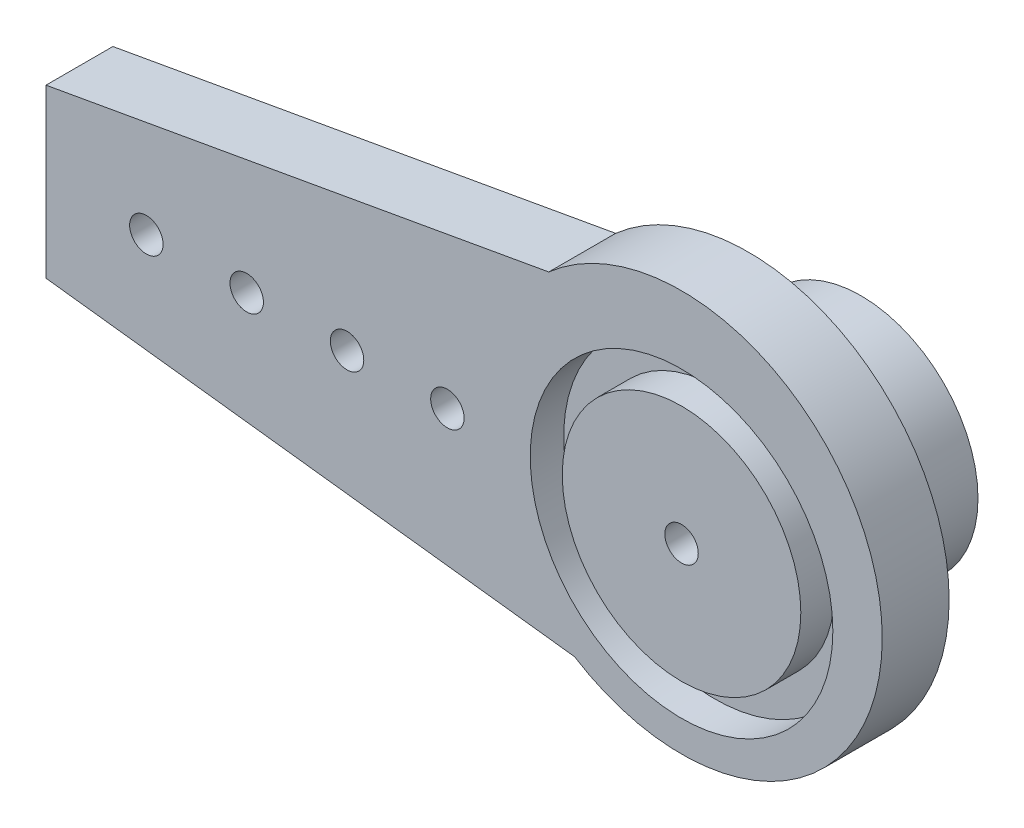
ISO-10303-21;
HEADER;
FILE_DESCRIPTION(('STEP AP214'),'2;1');
FILE_NAME('part.step','',(''),(''),'','','');
FILE_SCHEMA(('AUTOMOTIVE_DESIGN { 1 0 10303 214 1 1 1 1 }'));
ENDSEC;
DATA;
#1=APPLICATION_CONTEXT('core data for automotive mechanical design processes');
#2=APPLICATION_PROTOCOL_DEFINITION('international standard','automotive_design',2000,#1);
#3=PRODUCT_CONTEXT('',#1,'mechanical');
#4=PRODUCT('Part','Part','',(#3));
#5=PRODUCT_RELATED_PRODUCT_CATEGORY('part','',(#4));
#6=PRODUCT_DEFINITION_FORMATION('','',#4);
#7=PRODUCT_DEFINITION_CONTEXT('part definition',#1,'design');
#8=PRODUCT_DEFINITION('design','',#6,#7);
#9=PRODUCT_DEFINITION_SHAPE('','',#8);
#10=(LENGTH_UNIT() NAMED_UNIT(*) SI_UNIT(.MILLI.,.METRE.));
#11=(NAMED_UNIT(*) PLANE_ANGLE_UNIT() SI_UNIT($,.RADIAN.));
#12=(NAMED_UNIT(*) SI_UNIT($,.STERADIAN.) SOLID_ANGLE_UNIT());
#13=UNCERTAINTY_MEASURE_WITH_UNIT(LENGTH_MEASURE(1.E-05),#10,'distance_accuracy_value','');
#14=(GEOMETRIC_REPRESENTATION_CONTEXT(3) GLOBAL_UNCERTAINTY_ASSIGNED_CONTEXT((#13)) GLOBAL_UNIT_ASSIGNED_CONTEXT((#10,
#11,#12)) REPRESENTATION_CONTEXT('',''));
#15=CARTESIAN_POINT('',(0.,0.,0.));
#16=DIRECTION('',(0.,0.,1.));
#17=DIRECTION('',(1.,0.,0.));
#18=AXIS2_PLACEMENT_3D('',#15,#16,#17);
#19=CARTESIAN_POINT('',(-2.61728395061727,1.77395683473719,17.));
#20=DIRECTION('',(0.,0.,1.));
#21=DIRECTION('',(1.,0.,0.));
#22=AXIS2_PLACEMENT_3D('',#19,#20,#21);
#23=PLANE('',#22);
#24=CARTESIAN_POINT('',(-2.25433095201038,1.82701079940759,17.));
#25=DIRECTION('',(0.,0.,-1.));
#26=DIRECTION('',(-1.,0.,0.));
#27=AXIS2_PLACEMENT_3D('',#24,#25,#26);
#28=CIRCLE('',#27,3.);
#29=CARTESIAN_POINT('',(-5.25433095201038,1.82701079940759,17.));
#30=VERTEX_POINT('',#29);
#31=EDGE_CURVE('E186',#30,#30,#28,.T.);
#32=ORIENTED_EDGE('',*,*,#31,.F.);
#33=EDGE_LOOP('',(#32));
#34=FACE_BOUND('',#33,.T.);
#35=CARTESIAN_POINT('',(-2.25433095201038,1.82701079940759,17.));
#36=DIRECTION('',(0.,0.,-1.));
#37=DIRECTION('',(-1.,0.,0.));
#38=AXIS2_PLACEMENT_3D('',#35,#36,#37);
#39=CIRCLE('',#38,3.5);
#40=CARTESIAN_POINT('',(-5.75433095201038,1.82701079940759,17.));
#41=VERTEX_POINT('',#40);
#42=EDGE_CURVE('E238',#41,#41,#39,.T.);
#43=ORIENTED_EDGE('',*,*,#42,.T.);
#44=EDGE_LOOP('',(#43));
#45=FACE_BOUND('',#44,.T.);
#46=ADVANCED_FACE('F108',(#34,#45),#23,.F.);
#47=CARTESIAN_POINT('',(-21.6172839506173,3.59495368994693,22.));
#48=DIRECTION('',(-0.175441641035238,0.984489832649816,0.));
#49=DIRECTION('',(-0.984489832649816,-0.175441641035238,0.));
#50=AXIS2_PLACEMENT_3D('',#47,#48,#49);
#51=PLANE('',#50);
#52=DIRECTION('',(0.,0.,-1.));
#53=VECTOR('',#52,1.);
#54=CARTESIAN_POINT('',(-6.58637651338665,6.27354617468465,22.));
#55=LINE('',#54,#53);
#56=CARTESIAN_POINT('',(-6.58637651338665,6.27354617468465,22.));
#57=VERTEX_POINT('',#56);
#58=CARTESIAN_POINT('',(-6.58637651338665,6.27354617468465,20.));
#59=VERTEX_POINT('',#58);
#60=EDGE_CURVE('E171',#57,#59,#55,.T.);
#61=ORIENTED_EDGE('',*,*,#60,.T.);
#62=DIRECTION('',(-0.984489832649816,-0.175441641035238,0.));
#63=VECTOR('',#62,1.);
#64=CARTESIAN_POINT('',(-21.6172839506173,3.59495368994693,20.));
#65=LINE('',#64,#63);
#66=CARTESIAN_POINT('',(-21.6172839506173,3.59495368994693,20.));
#67=VERTEX_POINT('',#66);
#68=EDGE_CURVE('E125',#59,#67,#65,.T.);
#69=ORIENTED_EDGE('',*,*,#68,.T.);
#70=DIRECTION('',(0.,0.,-1.));
#71=VECTOR('',#70,1.);
#72=CARTESIAN_POINT('',(-21.6172839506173,3.59495368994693,22.));
#73=LINE('',#72,#71);
#74=CARTESIAN_POINT('',(-21.6172839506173,3.59495368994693,22.));
#75=VERTEX_POINT('',#74);
#76=EDGE_CURVE('E12',#75,#67,#73,.T.);
#77=ORIENTED_EDGE('',*,*,#76,.F.);
#78=DIRECTION('',(0.984489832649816,0.175441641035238,0.));
#79=VECTOR('',#78,1.);
#80=CARTESIAN_POINT('',(-21.6172839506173,3.59495368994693,22.));
#81=LINE('',#80,#79);
#82=EDGE_CURVE('E218',#75,#57,#81,.T.);
#83=ORIENTED_EDGE('',*,*,#82,.T.);
#84=EDGE_LOOP('',(#61,#69,#77,#83));
#85=FACE_BOUND('',#84,.T.);
#86=ADVANCED_FACE('F110',(#85),#51,.T.);
#87=CARTESIAN_POINT('',(-21.6172839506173,3.59495368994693,22.));
#88=DIRECTION('',(1.,0.,0.));
#89=DIRECTION('',(0.,1.,0.));
#90=AXIS2_PLACEMENT_3D('',#87,#88,#89);
#91=PLANE('',#90);
#92=DIRECTION('',(0.,1.,0.));
#93=VECTOR('',#92,1.);
#94=CARTESIAN_POINT('',(-21.6172839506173,3.59495368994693,20.));
#95=LINE('',#94,#93);
#96=CARTESIAN_POINT('',(-21.6172839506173,-1.40504631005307,20.));
#97=VERTEX_POINT('',#96);
#98=EDGE_CURVE('E167',#97,#67,#95,.T.);
#99=ORIENTED_EDGE('',*,*,#98,.F.);
#100=DIRECTION('',(0.,0.,-1.));
#101=VECTOR('',#100,1.);
#102=CARTESIAN_POINT('',(-21.6172839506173,-1.40504631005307,22.));
#103=LINE('',#102,#101);
#104=CARTESIAN_POINT('',(-21.6172839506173,-1.40504631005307,22.));
#105=VERTEX_POINT('',#104);
#106=EDGE_CURVE('E117',#105,#97,#103,.T.);
#107=ORIENTED_EDGE('',*,*,#106,.F.);
#108=DIRECTION('',(0.,-1.,0.));
#109=VECTOR('',#108,1.);
#110=CARTESIAN_POINT('',(-21.6172839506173,3.59495368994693,22.));
#111=LINE('',#110,#109);
#112=EDGE_CURVE('E174',#75,#105,#111,.T.);
#113=ORIENTED_EDGE('',*,*,#112,.F.);
#114=ORIENTED_EDGE('',*,*,#76,.T.);
#115=EDGE_LOOP('',(#99,#107,#113,#114));
#116=FACE_BOUND('',#115,.T.);
#117=ADVANCED_FACE('F228',(#116),#91,.F.);
#118=CARTESIAN_POINT('',(-21.6172839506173,-1.40504631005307,22.));
#119=DIRECTION('',(0.119253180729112,0.99286387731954,0.));
#120=DIRECTION('',(-0.99286387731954,0.119253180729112,0.));
#121=AXIS2_PLACEMENT_3D('',#118,#119,#120);
#122=PLANE('',#121);
#123=DIRECTION('',(-0.99286387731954,0.119253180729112,0.));
#124=VECTOR('',#123,1.);
#125=CARTESIAN_POINT('',(-21.6172839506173,-1.40504631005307,20.));
#126=LINE('',#125,#124);
#127=CARTESIAN_POINT('',(-5.81470581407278,-3.30309875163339,20.));
#128=VERTEX_POINT('',#127);
#129=EDGE_CURVE('E151',#128,#97,#126,.T.);
#130=ORIENTED_EDGE('',*,*,#129,.F.);
#131=DIRECTION('',(0.,0.,-1.));
#132=VECTOR('',#131,1.);
#133=CARTESIAN_POINT('',(-5.81470581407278,-3.30309875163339,22.));
#134=LINE('',#133,#132);
#135=CARTESIAN_POINT('',(-5.81470581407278,-3.30309875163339,22.));
#136=VERTEX_POINT('',#135);
#137=EDGE_CURVE('E164',#136,#128,#134,.T.);
#138=ORIENTED_EDGE('',*,*,#137,.F.);
#139=DIRECTION('',(0.99286387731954,-0.119253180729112,0.));
#140=VECTOR('',#139,1.);
#141=CARTESIAN_POINT('',(-21.6172839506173,-1.40504631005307,22.));
#142=LINE('',#141,#140);
#143=EDGE_CURVE('E221',#105,#136,#142,.T.);
#144=ORIENTED_EDGE('',*,*,#143,.F.);
#145=ORIENTED_EDGE('',*,*,#106,.T.);
#146=EDGE_LOOP('',(#130,#138,#144,#145));
#147=FACE_BOUND('',#146,.T.);
#148=ADVANCED_FACE('F162',(#147),#122,.F.);
#149=CARTESIAN_POINT('',(-2.61728395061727,1.77395683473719,22.));
#150=DIRECTION('',(0.,0.,-1.));
#151=DIRECTION('',(-1.,0.,0.));
#152=AXIS2_PLACEMENT_3D('',#149,#150,#151);
#153=CYLINDRICAL_SURFACE('',#152,6.);
#154=CARTESIAN_POINT('',(-2.61728395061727,1.77395683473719,20.));
#155=DIRECTION('',(0.,0.,-1.));
#156=DIRECTION('',(-1.,0.,0.));
#157=AXIS2_PLACEMENT_3D('',#154,#155,#156);
#158=CIRCLE('',#157,6.);
#159=EDGE_CURVE('E147',#59,#128,#158,.T.);
#160=ORIENTED_EDGE('',*,*,#159,.F.);
#161=ORIENTED_EDGE('',*,*,#60,.F.);
#162=CARTESIAN_POINT('',(-2.61728395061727,1.77395683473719,22.));
#163=DIRECTION('',(0.,0.,1.));
#164=DIRECTION('',(1.,0.,0.));
#165=AXIS2_PLACEMENT_3D('',#162,#163,#164);
#166=CIRCLE('',#165,6.);
#167=EDGE_CURVE('E170',#136,#57,#166,.T.);
#168=ORIENTED_EDGE('',*,*,#167,.F.);
#169=ORIENTED_EDGE('',*,*,#137,.T.);
#170=EDGE_LOOP('',(#160,#161,#168,#169));
#171=FACE_BOUND('',#170,.T.);
#172=ADVANCED_FACE('F169',(#171),#153,.T.);
#173=CARTESIAN_POINT('',(-9.61728395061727,1.22208913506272,22.));
#174=DIRECTION('',(0.,0.,-1.));
#175=DIRECTION('',(-1.,0.,0.));
#176=AXIS2_PLACEMENT_3D('',#173,#174,#175);
#177=CYLINDRICAL_SURFACE('',#176,0.499999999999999);
#178=CARTESIAN_POINT('',(-9.61728395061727,1.22208913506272,22.));
#179=DIRECTION('',(0.,0.,1.));
#180=DIRECTION('',(1.,0.,0.));
#181=AXIS2_PLACEMENT_3D('',#178,#179,#180);
#182=CIRCLE('',#181,0.499999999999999);
#183=CARTESIAN_POINT('',(-9.11728395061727,1.22208913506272,22.));
#184=VERTEX_POINT('',#183);
#185=EDGE_CURVE('E212',#184,#184,#182,.T.);
#186=ORIENTED_EDGE('',*,*,#185,.T.);
#187=EDGE_LOOP('',(#186));
#188=FACE_BOUND('',#187,.T.);
#189=CARTESIAN_POINT('',(-9.61728395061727,1.22208913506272,20.));
#190=DIRECTION('',(0.,0.,-1.));
#191=DIRECTION('',(-1.,0.,0.));
#192=AXIS2_PLACEMENT_3D('',#189,#190,#191);
#193=CIRCLE('',#192,0.499999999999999);
#194=CARTESIAN_POINT('',(-10.1172839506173,1.22208913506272,20.));
#195=VERTEX_POINT('',#194);
#196=EDGE_CURVE('E157',#195,#195,#193,.T.);
#197=ORIENTED_EDGE('',*,*,#196,.T.);
#198=EDGE_LOOP('',(#197));
#199=FACE_BOUND('',#198,.T.);
#200=ADVANCED_FACE('F278',(#188,#199),#177,.F.);
#201=CARTESIAN_POINT('',(-12.6172839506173,1.22208913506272,22.));
#202=DIRECTION('',(0.,0.,-1.));
#203=DIRECTION('',(-1.,0.,0.));
#204=AXIS2_PLACEMENT_3D('',#201,#202,#203);
#205=CYLINDRICAL_SURFACE('',#204,0.499999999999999);
#206=CARTESIAN_POINT('',(-12.6172839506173,1.22208913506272,22.));
#207=DIRECTION('',(0.,0.,1.));
#208=DIRECTION('',(1.,0.,0.));
#209=AXIS2_PLACEMENT_3D('',#206,#207,#208);
#210=CIRCLE('',#209,0.499999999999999);
#211=CARTESIAN_POINT('',(-12.1172839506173,1.22208913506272,22.));
#212=VERTEX_POINT('',#211);
#213=EDGE_CURVE('E209',#212,#212,#210,.T.);
#214=ORIENTED_EDGE('',*,*,#213,.T.);
#215=EDGE_LOOP('',(#214));
#216=FACE_BOUND('',#215,.T.);
#217=CARTESIAN_POINT('',(-12.6172839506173,1.22208913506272,20.));
#218=DIRECTION('',(0.,0.,-1.));
#219=DIRECTION('',(-1.,0.,0.));
#220=AXIS2_PLACEMENT_3D('',#217,#218,#219);
#221=CIRCLE('',#220,0.499999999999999);
#222=CARTESIAN_POINT('',(-13.1172839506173,1.22208913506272,20.));
#223=VERTEX_POINT('',#222);
#224=EDGE_CURVE('E232',#223,#223,#221,.T.);
#225=ORIENTED_EDGE('',*,*,#224,.T.);
#226=EDGE_LOOP('',(#225));
#227=FACE_BOUND('',#226,.T.);
#228=ADVANCED_FACE('F282',(#216,#227),#205,.F.);
#229=CARTESIAN_POINT('',(-15.6172839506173,1.22208913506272,22.));
#230=DIRECTION('',(0.,0.,-1.));
#231=DIRECTION('',(-1.,0.,0.));
#232=AXIS2_PLACEMENT_3D('',#229,#230,#231);
#233=CYLINDRICAL_SURFACE('',#232,0.499999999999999);
#234=CARTESIAN_POINT('',(-15.6172839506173,1.22208913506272,22.));
#235=DIRECTION('',(0.,0.,1.));
#236=DIRECTION('',(1.,0.,0.));
#237=AXIS2_PLACEMENT_3D('',#234,#235,#236);
#238=CIRCLE('',#237,0.499999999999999);
#239=CARTESIAN_POINT('',(-15.1172839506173,1.22208913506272,22.));
#240=VERTEX_POINT('',#239);
#241=EDGE_CURVE('E206',#240,#240,#238,.T.);
#242=ORIENTED_EDGE('',*,*,#241,.T.);
#243=EDGE_LOOP('',(#242));
#244=FACE_BOUND('',#243,.T.);
#245=CARTESIAN_POINT('',(-15.6172839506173,1.22208913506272,20.));
#246=DIRECTION('',(0.,0.,-1.));
#247=DIRECTION('',(-1.,0.,0.));
#248=AXIS2_PLACEMENT_3D('',#245,#246,#247);
#249=CIRCLE('',#248,0.499999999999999);
#250=CARTESIAN_POINT('',(-16.1172839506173,1.22208913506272,20.));
#251=VERTEX_POINT('',#250);
#252=EDGE_CURVE('E235',#251,#251,#249,.T.);
#253=ORIENTED_EDGE('',*,*,#252,.T.);
#254=EDGE_LOOP('',(#253));
#255=FACE_BOUND('',#254,.T.);
#256=ADVANCED_FACE('F288',(#244,#255),#233,.F.);
#257=CARTESIAN_POINT('',(-18.6172839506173,1.22208913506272,22.));
#258=DIRECTION('',(0.,0.,-1.));
#259=DIRECTION('',(-1.,0.,0.));
#260=AXIS2_PLACEMENT_3D('',#257,#258,#259);
#261=CYLINDRICAL_SURFACE('',#260,0.499999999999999);
#262=CARTESIAN_POINT('',(-18.6172839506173,1.22208913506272,22.));
#263=DIRECTION('',(0.,0.,1.));
#264=DIRECTION('',(1.,0.,0.));
#265=AXIS2_PLACEMENT_3D('',#262,#263,#264);
#266=CIRCLE('',#265,0.499999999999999);
#267=CARTESIAN_POINT('',(-18.1172839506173,1.22208913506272,22.));
#268=VERTEX_POINT('',#267);
#269=EDGE_CURVE('E201',#268,#268,#266,.T.);
#270=ORIENTED_EDGE('',*,*,#269,.T.);
#271=EDGE_LOOP('',(#270));
#272=FACE_BOUND('',#271,.T.);
#273=CARTESIAN_POINT('',(-18.6172839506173,1.22208913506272,20.));
#274=DIRECTION('',(0.,0.,-1.));
#275=DIRECTION('',(-1.,0.,0.));
#276=AXIS2_PLACEMENT_3D('',#273,#274,#275);
#277=CIRCLE('',#276,0.499999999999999);
#278=CARTESIAN_POINT('',(-19.1172839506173,1.22208913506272,20.));
#279=VERTEX_POINT('',#278);
#280=EDGE_CURVE('E112',#279,#279,#277,.T.);
#281=ORIENTED_EDGE('',*,*,#280,.T.);
#282=EDGE_LOOP('',(#281));
#283=FACE_BOUND('',#282,.T.);
#284=ADVANCED_FACE('F248',(#272,#283),#261,.F.);
#285=CARTESIAN_POINT('',(-2.61728395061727,1.22208913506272,22.));
#286=DIRECTION('',(0.,0.,-1.));
#287=DIRECTION('',(-1.,0.,0.));
#288=AXIS2_PLACEMENT_3D('',#285,#286,#287);
#289=CYLINDRICAL_SURFACE('',#288,0.499999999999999);
#290=CARTESIAN_POINT('',(-2.61728395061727,1.22208913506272,22.));
#291=DIRECTION('',(0.,0.,1.));
#292=DIRECTION('',(1.,0.,0.));
#293=AXIS2_PLACEMENT_3D('',#290,#291,#292);
#294=CIRCLE('',#293,0.499999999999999);
#295=CARTESIAN_POINT('',(-2.11728395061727,1.22208913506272,22.));
#296=VERTEX_POINT('',#295);
#297=EDGE_CURVE('E215',#296,#296,#294,.T.);
#298=ORIENTED_EDGE('',*,*,#297,.T.);
#299=EDGE_LOOP('',(#298));
#300=FACE_BOUND('',#299,.T.);
#301=CARTESIAN_POINT('',(-2.61728395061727,1.22208913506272,20.));
#302=DIRECTION('',(0.,0.,-1.));
#303=DIRECTION('',(-1.,0.,0.));
#304=AXIS2_PLACEMENT_3D('',#301,#302,#303);
#305=CIRCLE('',#304,0.499999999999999);
#306=CARTESIAN_POINT('',(-3.11728395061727,1.22208913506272,20.));
#307=VERTEX_POINT('',#306);
#308=EDGE_CURVE('E176',#307,#307,#305,.T.);
#309=ORIENTED_EDGE('',*,*,#308,.T.);
#310=EDGE_LOOP('',(#309));
#311=FACE_BOUND('',#310,.T.);
#312=ADVANCED_FACE('F293',(#300,#311),#289,.F.);
#313=CARTESIAN_POINT('',(-2.61728395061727,1.77395683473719,22.));
#314=DIRECTION('',(0.,0.,1.));
#315=DIRECTION('',(1.,0.,0.));
#316=AXIS2_PLACEMENT_3D('',#313,#314,#315);
#317=PLANE('',#316);
#318=ORIENTED_EDGE('',*,*,#297,.F.);
#319=EDGE_LOOP('',(#318));
#320=FACE_BOUND('',#319,.T.);
#321=CARTESIAN_POINT('',(-2.61728395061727,1.22208913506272,22.));
#322=DIRECTION('',(0.,0.,1.));
#323=DIRECTION('',(1.,0.,0.));
#324=AXIS2_PLACEMENT_3D('',#321,#322,#323);
#325=CIRCLE('',#324,3.56637725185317);
#326=CARTESIAN_POINT('',(0.949093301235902,1.22208913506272,22.));
#327=VERTEX_POINT('',#326);
#328=EDGE_CURVE('E178',#327,#327,#325,.T.);
#329=ORIENTED_EDGE('',*,*,#328,.T.);
#330=EDGE_LOOP('',(#329));
#331=FACE_BOUND('',#330,.T.);
#332=ADVANCED_FACE('F295',(#320,#331),#317,.T.);
#333=CARTESIAN_POINT('',(-2.61728395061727,1.22208913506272,22.));
#334=DIRECTION('',(0.,0.,1.));
#335=DIRECTION('',(1.,0.,0.));
#336=AXIS2_PLACEMENT_3D('',#333,#334,#335);
#337=CIRCLE('',#336,4.52393171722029);
#338=CARTESIAN_POINT('',(1.90664776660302,1.22208913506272,22.));
#339=VERTEX_POINT('',#338);
#340=EDGE_CURVE('E196',#339,#339,#337,.T.);
#341=ORIENTED_EDGE('',*,*,#340,.F.);
#342=EDGE_LOOP('',(#341));
#343=FACE_BOUND('',#342,.T.);
#344=ORIENTED_EDGE('',*,*,#241,.F.);
#345=EDGE_LOOP('',(#344));
#346=FACE_BOUND('',#345,.T.);
#347=ORIENTED_EDGE('',*,*,#185,.F.);
#348=EDGE_LOOP('',(#347));
#349=FACE_BOUND('',#348,.T.);
#350=ORIENTED_EDGE('',*,*,#82,.F.);
#351=ORIENTED_EDGE('',*,*,#112,.T.);
#352=ORIENTED_EDGE('',*,*,#143,.T.);
#353=ORIENTED_EDGE('',*,*,#167,.T.);
#354=EDGE_LOOP('',(#350,#351,#352,#353));
#355=FACE_BOUND('',#354,.T.);
#356=ORIENTED_EDGE('',*,*,#213,.F.);
#357=EDGE_LOOP('',(#356));
#358=FACE_BOUND('',#357,.T.);
#359=ORIENTED_EDGE('',*,*,#269,.F.);
#360=EDGE_LOOP('',(#359));
#361=FACE_BOUND('',#360,.T.);
#362=ADVANCED_FACE('F225',(#343,#346,#349,#355,#358,#361),#317,.T.);
#363=CARTESIAN_POINT('',(-2.61728395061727,1.22208913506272,21.));
#364=DIRECTION('',(0.,0.,1.));
#365=DIRECTION('',(1.,0.,0.));
#366=AXIS2_PLACEMENT_3D('',#363,#364,#365);
#367=CYLINDRICAL_SURFACE('',#366,4.52393171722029);
#368=CARTESIAN_POINT('',(-2.61728395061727,1.22208913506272,21.));
#369=DIRECTION('',(0.,0.,1.));
#370=DIRECTION('',(1.,0.,0.));
#371=AXIS2_PLACEMENT_3D('',#368,#369,#370);
#372=CIRCLE('',#371,4.52393171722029);
#373=CARTESIAN_POINT('',(1.90664776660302,1.22208913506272,21.));
#374=VERTEX_POINT('',#373);
#375=EDGE_CURVE('E198',#374,#374,#372,.T.);
#376=ORIENTED_EDGE('',*,*,#375,.F.);
#377=EDGE_LOOP('',(#376));
#378=FACE_BOUND('',#377,.T.);
#379=ORIENTED_EDGE('',*,*,#340,.T.);
#380=EDGE_LOOP('',(#379));
#381=FACE_BOUND('',#380,.T.);
#382=ADVANCED_FACE('F319',(#378,#381),#367,.F.);
#383=CARTESIAN_POINT('',(-2.61728395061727,1.22208913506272,21.));
#384=DIRECTION('',(0.,0.,1.));
#385=DIRECTION('',(1.,0.,0.));
#386=AXIS2_PLACEMENT_3D('',#383,#384,#385);
#387=PLANE('',#386);
#388=CARTESIAN_POINT('',(-2.61728395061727,1.22208913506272,21.));
#389=DIRECTION('',(0.,0.,1.));
#390=DIRECTION('',(1.,0.,0.));
#391=AXIS2_PLACEMENT_3D('',#388,#389,#390);
#392=CIRCLE('',#391,3.56637725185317);
#393=CARTESIAN_POINT('',(0.949093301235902,1.22208913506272,21.));
#394=VERTEX_POINT('',#393);
#395=EDGE_CURVE('E183',#394,#394,#392,.T.);
#396=ORIENTED_EDGE('',*,*,#395,.F.);
#397=EDGE_LOOP('',(#396));
#398=FACE_BOUND('',#397,.T.);
#399=ORIENTED_EDGE('',*,*,#375,.T.);
#400=EDGE_LOOP('',(#399));
#401=FACE_BOUND('',#400,.T.);
#402=ADVANCED_FACE('F310',(#398,#401),#387,.T.);
#403=CARTESIAN_POINT('',(-2.61728395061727,1.22208913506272,21.));
#404=DIRECTION('',(0.,0.,1.));
#405=DIRECTION('',(1.,0.,0.));
#406=AXIS2_PLACEMENT_3D('',#403,#404,#405);
#407=CYLINDRICAL_SURFACE('',#406,3.56637725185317);
#408=ORIENTED_EDGE('',*,*,#395,.T.);
#409=EDGE_LOOP('',(#408));
#410=FACE_BOUND('',#409,.T.);
#411=ORIENTED_EDGE('',*,*,#328,.F.);
#412=EDGE_LOOP('',(#411));
#413=FACE_BOUND('',#412,.T.);
#414=ADVANCED_FACE('F308',(#410,#413),#407,.T.);
#415=CARTESIAN_POINT('',(-2.25433095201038,1.82701079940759,20.));
#416=DIRECTION('',(0.,0.,-1.));
#417=DIRECTION('',(-1.,0.,0.));
#418=AXIS2_PLACEMENT_3D('',#415,#416,#417);
#419=CYLINDRICAL_SURFACE('',#418,3.);
#420=CARTESIAN_POINT('',(-2.25433095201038,1.82701079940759,20.));
#421=DIRECTION('',(0.,0.,-1.));
#422=DIRECTION('',(-1.,0.,0.));
#423=AXIS2_PLACEMENT_3D('',#420,#421,#422);
#424=CIRCLE('',#423,3.);
#425=CARTESIAN_POINT('',(-5.25433095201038,1.82701079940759,20.));
#426=VERTEX_POINT('',#425);
#427=EDGE_CURVE('E179',#426,#426,#424,.T.);
#428=ORIENTED_EDGE('',*,*,#427,.F.);
#429=EDGE_LOOP('',(#428));
#430=FACE_BOUND('',#429,.T.);
#431=ORIENTED_EDGE('',*,*,#31,.T.);
#432=EDGE_LOOP('',(#431));
#433=FACE_BOUND('',#432,.T.);
#434=ADVANCED_FACE('F260',(#430,#433),#419,.F.);
#435=CARTESIAN_POINT('',(-2.25433095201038,1.82701079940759,20.));
#436=DIRECTION('',(0.,0.,-1.));
#437=DIRECTION('',(-1.,0.,0.));
#438=AXIS2_PLACEMENT_3D('',#435,#436,#437);
#439=PLANE('',#438);
#440=ORIENTED_EDGE('',*,*,#308,.F.);
#441=EDGE_LOOP('',(#440));
#442=FACE_BOUND('',#441,.T.);
#443=ORIENTED_EDGE('',*,*,#427,.T.);
#444=EDGE_LOOP('',(#443));
#445=FACE_BOUND('',#444,.T.);
#446=ADVANCED_FACE('F253',(#442,#445),#439,.T.);
#447=CARTESIAN_POINT('',(0.,0.,20.));
#448=DIRECTION('',(0.,0.,-1.));
#449=DIRECTION('',(-1.,0.,0.));
#450=AXIS2_PLACEMENT_3D('',#447,#448,#449);
#451=PLANE('',#450);
#452=ORIENTED_EDGE('',*,*,#159,.T.);
#453=ORIENTED_EDGE('',*,*,#129,.T.);
#454=ORIENTED_EDGE('',*,*,#98,.T.);
#455=ORIENTED_EDGE('',*,*,#68,.F.);
#456=EDGE_LOOP('',(#452,#453,#454,#455));
#457=FACE_BOUND('',#456,.T.);
#458=ORIENTED_EDGE('',*,*,#196,.F.);
#459=EDGE_LOOP('',(#458));
#460=FACE_BOUND('',#459,.T.);
#461=ORIENTED_EDGE('',*,*,#224,.F.);
#462=EDGE_LOOP('',(#461));
#463=FACE_BOUND('',#462,.T.);
#464=ORIENTED_EDGE('',*,*,#252,.F.);
#465=EDGE_LOOP('',(#464));
#466=FACE_BOUND('',#465,.T.);
#467=ORIENTED_EDGE('',*,*,#280,.F.);
#468=EDGE_LOOP('',(#467));
#469=FACE_BOUND('',#468,.T.);
#470=CARTESIAN_POINT('',(-2.25433095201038,1.82701079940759,20.));
#471=DIRECTION('',(0.,0.,-1.));
#472=DIRECTION('',(-1.,0.,0.));
#473=AXIS2_PLACEMENT_3D('',#470,#471,#472);
#474=CIRCLE('',#473,3.5);
#475=CARTESIAN_POINT('',(-5.75433095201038,1.82701079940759,20.));
#476=VERTEX_POINT('',#475);
#477=EDGE_CURVE('E241',#476,#476,#474,.T.);
#478=ORIENTED_EDGE('',*,*,#477,.F.);
#479=EDGE_LOOP('',(#478));
#480=FACE_BOUND('',#479,.T.);
#481=ADVANCED_FACE('F149',(#457,#460,#463,#466,#469,#480),#451,.T.);
#482=CARTESIAN_POINT('',(-2.25433095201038,1.82701079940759,20.));
#483=DIRECTION('',(0.,0.,-1.));
#484=DIRECTION('',(-1.,0.,0.));
#485=AXIS2_PLACEMENT_3D('',#482,#483,#484);
#486=CYLINDRICAL_SURFACE('',#485,3.5);
#487=ORIENTED_EDGE('',*,*,#477,.T.);
#488=EDGE_LOOP('',(#487));
#489=FACE_BOUND('',#488,.T.);
#490=ORIENTED_EDGE('',*,*,#42,.F.);
#491=EDGE_LOOP('',(#490));
#492=FACE_BOUND('',#491,.T.);
#493=ADVANCED_FACE('F252',(#489,#492),#486,.T.);
#494=CLOSED_SHELL('',(#46,#86,#117,#148,#172,#200,#228,#256,#284,#312,#332,#362,#382,#402,#414,
#434,#446,#481,#493));
#495=MANIFOLD_SOLID_BREP('B2',#494);
#496=ADVANCED_BREP_SHAPE_REPRESENTATION('',(#18,#495),#14);
#497=SHAPE_DEFINITION_REPRESENTATION(#9,#496);
ENDSEC;
END-ISO-10303-21;
